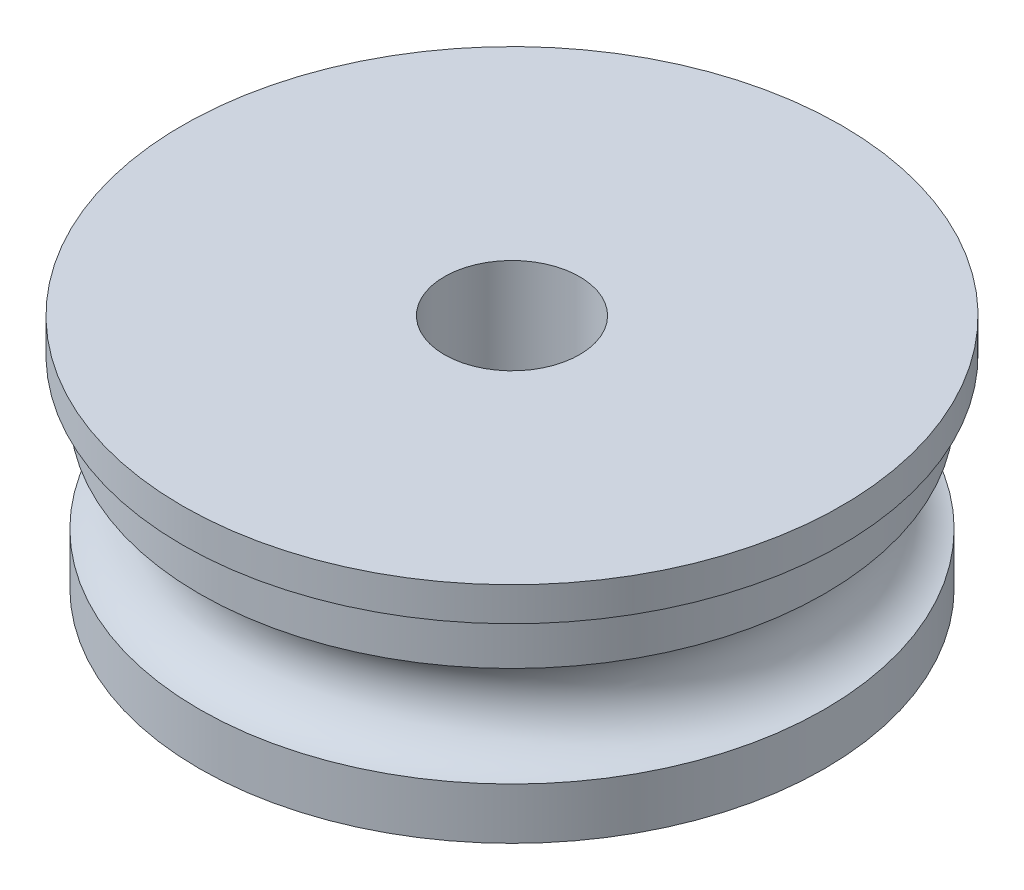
ISO-10303-21;
HEADER;
FILE_DESCRIPTION(('STEP AP214'),'2;1');
FILE_NAME('part.step','',(''),(''),'','','');
FILE_SCHEMA(('AUTOMOTIVE_DESIGN { 1 0 10303 214 1 1 1 1 }'));
ENDSEC;
DATA;
#1=APPLICATION_CONTEXT('core data for automotive mechanical design processes');
#2=APPLICATION_PROTOCOL_DEFINITION('international standard','automotive_design',2000,#1);
#3=PRODUCT_CONTEXT('',#1,'mechanical');
#4=PRODUCT('Part','Part','',(#3));
#5=PRODUCT_RELATED_PRODUCT_CATEGORY('part','',(#4));
#6=PRODUCT_DEFINITION_FORMATION('','',#4);
#7=PRODUCT_DEFINITION_CONTEXT('part definition',#1,'design');
#8=PRODUCT_DEFINITION('design','',#6,#7);
#9=PRODUCT_DEFINITION_SHAPE('','',#8);
#10=(LENGTH_UNIT() NAMED_UNIT(*) SI_UNIT(.MILLI.,.METRE.));
#11=(NAMED_UNIT(*) PLANE_ANGLE_UNIT() SI_UNIT($,.RADIAN.));
#12=(NAMED_UNIT(*) SI_UNIT($,.STERADIAN.) SOLID_ANGLE_UNIT());
#13=UNCERTAINTY_MEASURE_WITH_UNIT(LENGTH_MEASURE(1.E-05),#10,'distance_accuracy_value','');
#14=(GEOMETRIC_REPRESENTATION_CONTEXT(3) GLOBAL_UNCERTAINTY_ASSIGNED_CONTEXT((#13)) GLOBAL_UNIT_ASSIGNED_CONTEXT((#10,
#11,#12)) REPRESENTATION_CONTEXT('',''));
#15=CARTESIAN_POINT('',(0.,0.,0.));
#16=DIRECTION('',(0.,0.,1.));
#17=DIRECTION('',(1.,0.,0.));
#18=AXIS2_PLACEMENT_3D('',#15,#16,#17);
#19=CARTESIAN_POINT('',(0.,0.,0.));
#20=DIRECTION('',(0.,1.,0.));
#21=DIRECTION('',(0.,0.,1.));
#22=AXIS2_PLACEMENT_3D('',#19,#20,#21);
#23=CYLINDRICAL_SURFACE('',#22,2.);
#24=CARTESIAN_POINT('',(0.,6.98035138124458,0.));
#25=DIRECTION('',(0.,1.,0.));
#26=DIRECTION('',(0.,0.,1.));
#27=AXIS2_PLACEMENT_3D('',#24,#25,#26);
#28=CIRCLE('',#27,2.);
#29=CARTESIAN_POINT('',(0.,6.98035138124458,2.));
#30=VERTEX_POINT('',#29);
#31=EDGE_CURVE('E65',#30,#30,#28,.T.);
#32=ORIENTED_EDGE('',*,*,#31,.T.);
#33=EDGE_LOOP('',(#32));
#34=FACE_BOUND('',#33,.T.);
#35=CARTESIAN_POINT('',(0.,3.,0.));
#36=DIRECTION('',(0.,1.,0.));
#37=DIRECTION('',(0.,0.,1.));
#38=AXIS2_PLACEMENT_3D('',#35,#36,#37);
#39=CIRCLE('',#38,2.);
#40=CARTESIAN_POINT('',(0.,3.,2.));
#41=VERTEX_POINT('',#40);
#42=EDGE_CURVE('E10',#41,#41,#39,.T.);
#43=ORIENTED_EDGE('',*,*,#42,.F.);
#44=EDGE_LOOP('',(#43));
#45=FACE_BOUND('',#44,.T.);
#46=ADVANCED_FACE('F31',(#34,#45),#23,.F.);
#47=CARTESIAN_POINT('',(-2.,3.,0.));
#48=DIRECTION('',(0.,-1.,0.));
#49=DIRECTION('',(0.,0.,-1.));
#50=AXIS2_PLACEMENT_3D('',#47,#48,#49);
#51=PLANE('',#50);
#52=ORIENTED_EDGE('',*,*,#42,.T.);
#53=EDGE_LOOP('',(#52));
#54=FACE_BOUND('',#53,.T.);
#55=CARTESIAN_POINT('',(0.,3.,0.));
#56=DIRECTION('',(0.,1.,0.));
#57=DIRECTION('',(0.,0.,1.));
#58=AXIS2_PLACEMENT_3D('',#55,#56,#57);
#59=CIRCLE('',#58,6.);
#60=CARTESIAN_POINT('',(0.,3.,6.));
#61=VERTEX_POINT('',#60);
#62=EDGE_CURVE('E37',#61,#61,#59,.T.);
#63=ORIENTED_EDGE('',*,*,#62,.F.);
#64=EDGE_LOOP('',(#63));
#65=FACE_BOUND('',#64,.T.);
#66=ADVANCED_FACE('F83',(#54,#65),#51,.T.);
#67=CARTESIAN_POINT('',(0.,0.,0.));
#68=DIRECTION('',(0.,1.,0.));
#69=DIRECTION('',(0.,0.,1.));
#70=AXIS2_PLACEMENT_3D('',#67,#68,#69);
#71=CYLINDRICAL_SURFACE('',#70,6.);
#72=ORIENTED_EDGE('',*,*,#62,.T.);
#73=EDGE_LOOP('',(#72));
#74=FACE_BOUND('',#73,.T.);
#75=CARTESIAN_POINT('',(0.,0.,0.));
#76=DIRECTION('',(0.,1.,0.));
#77=DIRECTION('',(0.,0.,1.));
#78=AXIS2_PLACEMENT_3D('',#75,#76,#77);
#79=CIRCLE('',#78,6.);
#80=CARTESIAN_POINT('',(0.,0.,6.));
#81=VERTEX_POINT('',#80);
#82=EDGE_CURVE('E41',#81,#81,#79,.T.);
#83=ORIENTED_EDGE('',*,*,#82,.F.);
#84=EDGE_LOOP('',(#83));
#85=FACE_BOUND('',#84,.T.);
#86=ADVANCED_FACE('F87',(#74,#85),#71,.F.);
#87=CARTESIAN_POINT('',(-9.25,0.,0.));
#88=DIRECTION('',(0.,-1.,0.));
#89=DIRECTION('',(0.,0.,-1.));
#90=AXIS2_PLACEMENT_3D('',#87,#88,#89);
#91=PLANE('',#90);
#92=ORIENTED_EDGE('',*,*,#82,.T.);
#93=EDGE_LOOP('',(#92));
#94=FACE_BOUND('',#93,.T.);
#95=CARTESIAN_POINT('',(0.,0.,0.));
#96=DIRECTION('',(0.,1.,0.));
#97=DIRECTION('',(0.,0.,1.));
#98=AXIS2_PLACEMENT_3D('',#95,#96,#97);
#99=CIRCLE('',#98,9.25);
#100=CARTESIAN_POINT('',(0.,0.,9.25));
#101=VERTEX_POINT('',#100);
#102=EDGE_CURVE('E45',#101,#101,#99,.T.);
#103=ORIENTED_EDGE('',*,*,#102,.F.);
#104=EDGE_LOOP('',(#103));
#105=FACE_BOUND('',#104,.T.);
#106=ADVANCED_FACE('F91',(#94,#105),#91,.T.);
#107=CARTESIAN_POINT('',(0.,0.,0.));
#108=DIRECTION('',(0.,1.,0.));
#109=DIRECTION('',(0.,0.,1.));
#110=AXIS2_PLACEMENT_3D('',#107,#108,#109);
#111=CYLINDRICAL_SURFACE('',#110,9.25);
#112=ORIENTED_EDGE('',*,*,#102,.T.);
#113=EDGE_LOOP('',(#112));
#114=FACE_BOUND('',#113,.T.);
#115=CARTESIAN_POINT('',(0.,1.51964861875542,0.));
#116=DIRECTION('',(0.,1.,0.));
#117=DIRECTION('',(0.,0.,1.));
#118=AXIS2_PLACEMENT_3D('',#115,#116,#117);
#119=CIRCLE('',#118,9.25);
#120=CARTESIAN_POINT('',(0.,1.51964861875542,9.25));
#121=VERTEX_POINT('',#120);
#122=EDGE_CURVE('E50',#121,#121,#119,.T.);
#123=ORIENTED_EDGE('',*,*,#122,.F.);
#124=EDGE_LOOP('',(#123));
#125=FACE_BOUND('',#124,.T.);
#126=ADVANCED_FACE('F97',(#114,#125),#111,.T.);
#127=CARTESIAN_POINT('',(0.,3.,0.));
#128=DIRECTION('',(0.,1.,0.));
#129=DIRECTION('',(0.,0.,1.));
#130=AXIS2_PLACEMENT_3D('',#127,#128,#129);
#131=TOROIDAL_SURFACE('',#130,9.49199129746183,1.5);
#132=ORIENTED_EDGE('',*,*,#122,.T.);
#133=EDGE_LOOP('',(#132));
#134=FACE_BOUND('',#133,.T.);
#135=CARTESIAN_POINT('',(0.,4.48035138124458,0.));
#136=DIRECTION('',(0.,1.,0.));
#137=DIRECTION('',(0.,0.,1.));
#138=AXIS2_PLACEMENT_3D('',#135,#136,#137);
#139=CIRCLE('',#138,9.25);
#140=CARTESIAN_POINT('',(0.,4.48035138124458,9.25));
#141=VERTEX_POINT('',#140);
#142=EDGE_CURVE('E53',#141,#141,#139,.T.);
#143=ORIENTED_EDGE('',*,*,#142,.F.);
#144=EDGE_LOOP('',(#143));
#145=FACE_BOUND('',#144,.T.);
#146=ADVANCED_FACE('F101',(#134,#145),#131,.F.);
#147=CARTESIAN_POINT('',(0.,0.,0.));
#148=DIRECTION('',(0.,1.,0.));
#149=DIRECTION('',(0.,0.,1.));
#150=AXIS2_PLACEMENT_3D('',#147,#148,#149);
#151=CYLINDRICAL_SURFACE('',#150,9.25);
#152=ORIENTED_EDGE('',*,*,#142,.T.);
#153=EDGE_LOOP('',(#152));
#154=FACE_BOUND('',#153,.T.);
#155=CARTESIAN_POINT('',(0.,5.98035138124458,0.));
#156=DIRECTION('',(0.,1.,0.));
#157=DIRECTION('',(0.,0.,1.));
#158=AXIS2_PLACEMENT_3D('',#155,#156,#157);
#159=CIRCLE('',#158,9.25);
#160=CARTESIAN_POINT('',(0.,5.98035138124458,9.25));
#161=VERTEX_POINT('',#160);
#162=EDGE_CURVE('E56',#161,#161,#159,.T.);
#163=ORIENTED_EDGE('',*,*,#162,.F.);
#164=EDGE_LOOP('',(#163));
#165=FACE_BOUND('',#164,.T.);
#166=ADVANCED_FACE('F105',(#154,#165),#151,.T.);
#167=CARTESIAN_POINT('',(-9.75,5.98035138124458,0.));
#168=DIRECTION('',(0.,-1.,0.));
#169=DIRECTION('',(0.,0.,-1.));
#170=AXIS2_PLACEMENT_3D('',#167,#168,#169);
#171=PLANE('',#170);
#172=ORIENTED_EDGE('',*,*,#162,.T.);
#173=EDGE_LOOP('',(#172));
#174=FACE_BOUND('',#173,.T.);
#175=CARTESIAN_POINT('',(0.,5.98035138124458,0.));
#176=DIRECTION('',(0.,1.,0.));
#177=DIRECTION('',(0.,0.,1.));
#178=AXIS2_PLACEMENT_3D('',#175,#176,#177);
#179=CIRCLE('',#178,9.75);
#180=CARTESIAN_POINT('',(0.,5.98035138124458,9.75));
#181=VERTEX_POINT('',#180);
#182=EDGE_CURVE('E59',#181,#181,#179,.T.);
#183=ORIENTED_EDGE('',*,*,#182,.F.);
#184=EDGE_LOOP('',(#183));
#185=FACE_BOUND('',#184,.T.);
#186=ADVANCED_FACE('F79',(#174,#185),#171,.T.);
#187=CARTESIAN_POINT('',(0.,0.,0.));
#188=DIRECTION('',(0.,1.,0.));
#189=DIRECTION('',(0.,0.,1.));
#190=AXIS2_PLACEMENT_3D('',#187,#188,#189);
#191=CYLINDRICAL_SURFACE('',#190,9.75);
#192=ORIENTED_EDGE('',*,*,#182,.T.);
#193=EDGE_LOOP('',(#192));
#194=FACE_BOUND('',#193,.T.);
#195=CARTESIAN_POINT('',(0.,6.98035138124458,0.));
#196=DIRECTION('',(0.,1.,0.));
#197=DIRECTION('',(0.,0.,1.));
#198=AXIS2_PLACEMENT_3D('',#195,#196,#197);
#199=CIRCLE('',#198,9.75);
#200=CARTESIAN_POINT('',(0.,6.98035138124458,9.75));
#201=VERTEX_POINT('',#200);
#202=EDGE_CURVE('E62',#201,#201,#199,.T.);
#203=ORIENTED_EDGE('',*,*,#202,.F.);
#204=EDGE_LOOP('',(#203));
#205=FACE_BOUND('',#204,.T.);
#206=ADVANCED_FACE('F73',(#194,#205),#191,.T.);
#207=CARTESIAN_POINT('',(-9.75,6.98035138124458,0.));
#208=DIRECTION('',(0.,1.,0.));
#209=DIRECTION('',(0.,0.,1.));
#210=AXIS2_PLACEMENT_3D('',#207,#208,#209);
#211=PLANE('',#210);
#212=ORIENTED_EDGE('',*,*,#202,.T.);
#213=EDGE_LOOP('',(#212));
#214=FACE_BOUND('',#213,.T.);
#215=ORIENTED_EDGE('',*,*,#31,.F.);
#216=EDGE_LOOP('',(#215));
#217=FACE_BOUND('',#216,.T.);
#218=ADVANCED_FACE('F71',(#214,#217),#211,.T.);
#219=CLOSED_SHELL('',(#46,#66,#86,#106,#126,#146,#166,#186,#206,#218));
#220=MANIFOLD_SOLID_BREP('B2',#219);
#221=ADVANCED_BREP_SHAPE_REPRESENTATION('',(#18,#220),#14);
#222=SHAPE_DEFINITION_REPRESENTATION(#9,#221);
ENDSEC;
END-ISO-10303-21;
